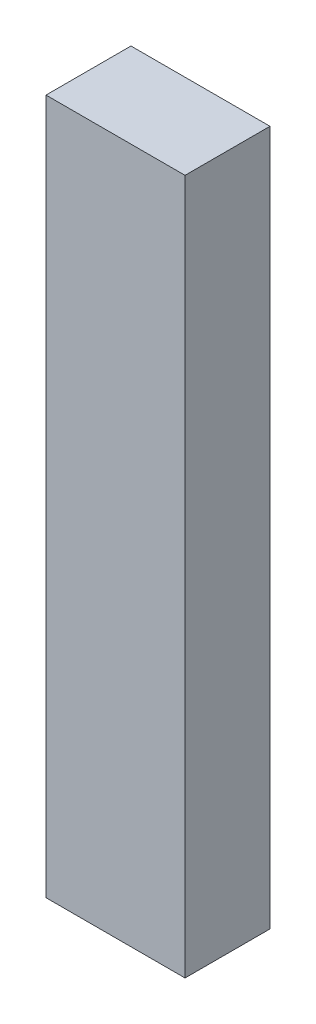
from build123d import *

# Parameters (mm, degrees)
SKETCH1_W           = 18
SKETCH1_H           = 11
BOSS_EXTRUDE1_DEPTH = 90


with BuildPart() as part:
    # Sketch1 → Boss-Extrude1 (new body)
    with BuildSketch(Plane(origin=(0, 0, 0), x_dir=(1, 0, 0), z_dir=(0, 1, 0))):
        Rectangle(SKETCH1_W, SKETCH1_H)
    extrude(amount=BOSS_EXTRUDE1_DEPTH)


solid = part.part
